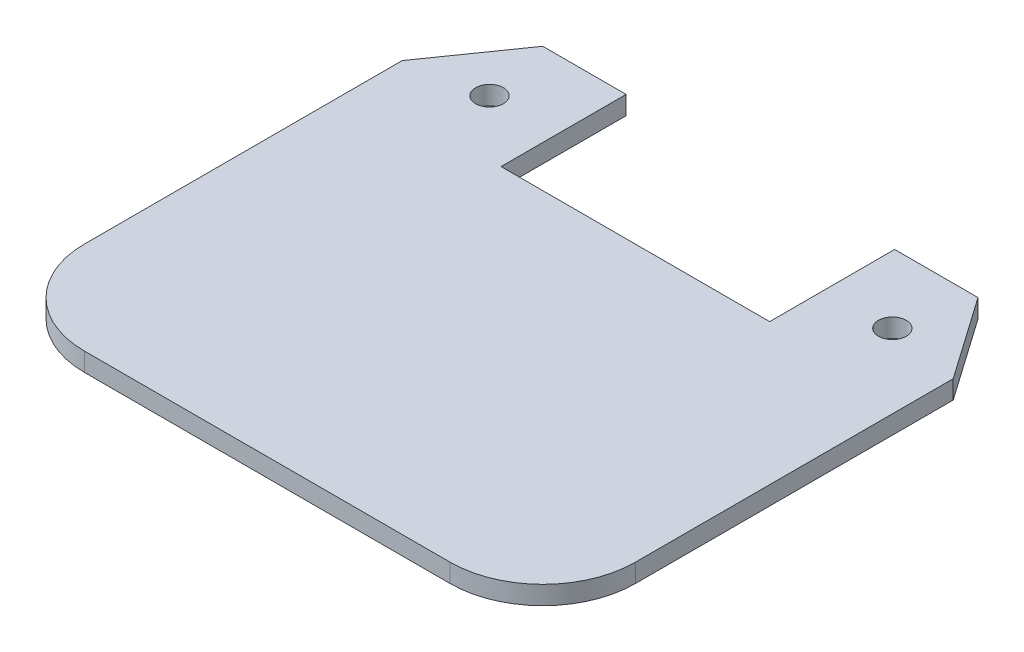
from build123d import *

# Parameters (mm, degrees)
EXTRUDE_1_DEPTH     = 0.4
SKETCH_2_R          = 0.3
SKETCH_2_W          = 5.8
SKETCH_2_H          = 2.7
CUT_EXTRUDE_1_DEPTH = 10
FILLET_1_R          = 2


with BuildPart() as part:
    # Sketch 1 → Extrude 1 (new body)
    with BuildSketch(Plane(origin=(0, 0, 0), x_dir=(1, 0, 0), z_dir=(0, 1, 0))):
        Polygon((5.95, 3.539814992), (4.7, 5.325), (-4.7, 5.325), (-5.95, 3.539814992), (-5.95, -5.325), (5.95, -5.325), align=None)
    extrude(amount=EXTRUDE_1_DEPTH)

    # Sketch 2 → Cut-Extrude 1 (cut)
    with BuildSketch(Plane(origin=(0, 0.4, 0), x_dir=(1, 0, 0), z_dir=(0, 1, 0))):
        with Locations(Location((-4.35, 3.825, 0), (0, 0, 270))):
            Circle(SKETCH_2_R)
        with Locations(Location((4.35, 3.825, 0), (0, 0, 270))):
            Circle(SKETCH_2_R)
        with Locations((0, 3.975)):
            Rectangle(SKETCH_2_W, SKETCH_2_H)
    extrude(amount=-CUT_EXTRUDE_1_DEPTH, mode=Mode.SUBTRACT)

    # Fillet 1
    fillet_1_edges = [part.edges().sort_by_distance(p)[0] for p in [
        (5.95, 0.2, 5.325),
        (-5.95, 0.2, 5.325),
    ]]
    fillet(fillet_1_edges, radius=FILLET_1_R)


solid = part.part
